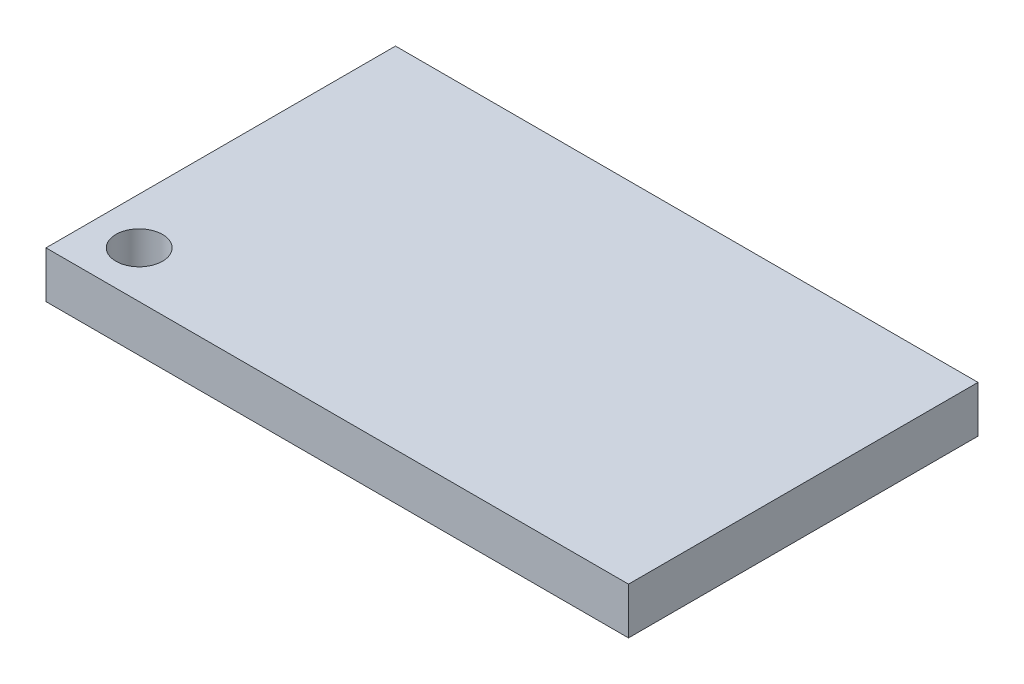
ISO-10303-21;
HEADER;
FILE_DESCRIPTION(('STEP AP214'),'2;1');
FILE_NAME('part.step','',(''),(''),'','','');
FILE_SCHEMA(('AUTOMOTIVE_DESIGN { 1 0 10303 214 1 1 1 1 }'));
ENDSEC;
DATA;
#1=APPLICATION_CONTEXT('core data for automotive mechanical design processes');
#2=APPLICATION_PROTOCOL_DEFINITION('international standard','automotive_design',2000,#1);
#3=PRODUCT_CONTEXT('',#1,'mechanical');
#4=PRODUCT('Part','Part','',(#3));
#5=PRODUCT_RELATED_PRODUCT_CATEGORY('part','',(#4));
#6=PRODUCT_DEFINITION_FORMATION('','',#4);
#7=PRODUCT_DEFINITION_CONTEXT('part definition',#1,'design');
#8=PRODUCT_DEFINITION('design','',#6,#7);
#9=PRODUCT_DEFINITION_SHAPE('','',#8);
#10=(LENGTH_UNIT() NAMED_UNIT(*) SI_UNIT(.MILLI.,.METRE.));
#11=(NAMED_UNIT(*) PLANE_ANGLE_UNIT() SI_UNIT($,.RADIAN.));
#12=(NAMED_UNIT(*) SI_UNIT($,.STERADIAN.) SOLID_ANGLE_UNIT());
#13=UNCERTAINTY_MEASURE_WITH_UNIT(LENGTH_MEASURE(1.E-05),#10,'distance_accuracy_value','');
#14=(GEOMETRIC_REPRESENTATION_CONTEXT(3) GLOBAL_UNCERTAINTY_ASSIGNED_CONTEXT((#13)) GLOBAL_UNIT_ASSIGNED_CONTEXT((#10,
#11,#12)) REPRESENTATION_CONTEXT('',''));
#15=CARTESIAN_POINT('',(0.,0.,0.));
#16=DIRECTION('',(0.,0.,1.));
#17=DIRECTION('',(1.,0.,0.));
#18=AXIS2_PLACEMENT_3D('',#15,#16,#17);
#19=CARTESIAN_POINT('',(0.,10.,0.));
#20=DIRECTION('',(1.,0.,0.));
#21=DIRECTION('',(0.,0.,-1.));
#22=AXIS2_PLACEMENT_3D('',#19,#20,#21);
#23=PLANE('',#22);
#24=DIRECTION('',(0.,0.,1.));
#25=VECTOR('',#24,1.);
#26=CARTESIAN_POINT('',(0.,0.,0.));
#27=LINE('',#26,#25);
#28=CARTESIAN_POINT('',(0.,0.,-75.));
#29=VERTEX_POINT('',#28);
#30=CARTESIAN_POINT('',(0.,0.,0.));
#31=VERTEX_POINT('',#30);
#32=EDGE_CURVE('E77',#29,#31,#27,.T.);
#33=ORIENTED_EDGE('',*,*,#32,.T.);
#34=DIRECTION('',(0.,-1.,0.));
#35=VECTOR('',#34,1.);
#36=CARTESIAN_POINT('',(0.,10.,0.));
#37=LINE('',#36,#35);
#38=CARTESIAN_POINT('',(0.,10.,0.));
#39=VERTEX_POINT('',#38);
#40=EDGE_CURVE('E11',#39,#31,#37,.T.);
#41=ORIENTED_EDGE('',*,*,#40,.F.);
#42=DIRECTION('',(0.,0.,1.));
#43=VECTOR('',#42,1.);
#44=CARTESIAN_POINT('',(0.,10.,0.));
#45=LINE('',#44,#43);
#46=CARTESIAN_POINT('',(0.,10.,-75.));
#47=VERTEX_POINT('',#46);
#48=EDGE_CURVE('E100',#47,#39,#45,.T.);
#49=ORIENTED_EDGE('',*,*,#48,.F.);
#50=DIRECTION('',(0.,-1.,0.));
#51=VECTOR('',#50,1.);
#52=CARTESIAN_POINT('',(0.,10.,-75.));
#53=LINE('',#52,#51);
#54=EDGE_CURVE('E89',#47,#29,#53,.T.);
#55=ORIENTED_EDGE('',*,*,#54,.T.);
#56=EDGE_LOOP('',(#33,#41,#49,#55));
#57=FACE_BOUND('',#56,.T.);
#58=ADVANCED_FACE('F33',(#57),#23,.F.);
#59=CARTESIAN_POINT('',(0.,10.,0.));
#60=DIRECTION('',(0.,0.,-1.));
#61=DIRECTION('',(-1.,0.,0.));
#62=AXIS2_PLACEMENT_3D('',#59,#60,#61);
#63=PLANE('',#62);
#64=DIRECTION('',(1.,0.,0.));
#65=VECTOR('',#64,1.);
#66=CARTESIAN_POINT('',(0.,0.,0.));
#67=LINE('',#66,#65);
#68=CARTESIAN_POINT('',(125.,0.,0.));
#69=VERTEX_POINT('',#68);
#70=EDGE_CURVE('E73',#31,#69,#67,.T.);
#71=ORIENTED_EDGE('',*,*,#70,.T.);
#72=DIRECTION('',(0.,-1.,0.));
#73=VECTOR('',#72,1.);
#74=CARTESIAN_POINT('',(125.,10.,0.));
#75=LINE('',#74,#73);
#76=CARTESIAN_POINT('',(125.,10.,0.));
#77=VERTEX_POINT('',#76);
#78=EDGE_CURVE('E40',#77,#69,#75,.T.);
#79=ORIENTED_EDGE('',*,*,#78,.F.);
#80=DIRECTION('',(1.,0.,0.));
#81=VECTOR('',#80,1.);
#82=CARTESIAN_POINT('',(0.,10.,0.));
#83=LINE('',#82,#81);
#84=EDGE_CURVE('E85',#39,#77,#83,.T.);
#85=ORIENTED_EDGE('',*,*,#84,.F.);
#86=ORIENTED_EDGE('',*,*,#40,.T.);
#87=EDGE_LOOP('',(#71,#79,#85,#86));
#88=FACE_BOUND('',#87,.T.);
#89=ADVANCED_FACE('F84',(#88),#63,.F.);
#90=CARTESIAN_POINT('',(125.,10.,0.));
#91=DIRECTION('',(-1.,0.,0.));
#92=DIRECTION('',(0.,0.,1.));
#93=AXIS2_PLACEMENT_3D('',#90,#91,#92);
#94=PLANE('',#93);
#95=DIRECTION('',(0.,0.,-1.));
#96=VECTOR('',#95,1.);
#97=CARTESIAN_POINT('',(125.,0.,0.));
#98=LINE('',#97,#96);
#99=CARTESIAN_POINT('',(125.,0.,-75.));
#100=VERTEX_POINT('',#99);
#101=EDGE_CURVE('E78',#69,#100,#98,.T.);
#102=ORIENTED_EDGE('',*,*,#101,.T.);
#103=DIRECTION('',(0.,-1.,0.));
#104=VECTOR('',#103,1.);
#105=CARTESIAN_POINT('',(125.,10.,-75.));
#106=LINE('',#105,#104);
#107=CARTESIAN_POINT('',(125.,10.,-75.));
#108=VERTEX_POINT('',#107);
#109=EDGE_CURVE('E106',#108,#100,#106,.T.);
#110=ORIENTED_EDGE('',*,*,#109,.F.);
#111=DIRECTION('',(0.,0.,-1.));
#112=VECTOR('',#111,1.);
#113=CARTESIAN_POINT('',(125.,10.,0.));
#114=LINE('',#113,#112);
#115=EDGE_CURVE('E52',#77,#108,#114,.T.);
#116=ORIENTED_EDGE('',*,*,#115,.F.);
#117=ORIENTED_EDGE('',*,*,#78,.T.);
#118=EDGE_LOOP('',(#102,#110,#116,#117));
#119=FACE_BOUND('',#118,.T.);
#120=ADVANCED_FACE('F109',(#119),#94,.F.);
#121=CARTESIAN_POINT('',(0.,10.,-75.));
#122=DIRECTION('',(0.,0.,1.));
#123=DIRECTION('',(1.,0.,0.));
#124=AXIS2_PLACEMENT_3D('',#121,#122,#123);
#125=PLANE('',#124);
#126=DIRECTION('',(-1.,0.,0.));
#127=VECTOR('',#126,1.);
#128=CARTESIAN_POINT('',(0.,0.,-75.));
#129=LINE('',#128,#127);
#130=EDGE_CURVE('E98',#100,#29,#129,.T.);
#131=ORIENTED_EDGE('',*,*,#130,.T.);
#132=ORIENTED_EDGE('',*,*,#54,.F.);
#133=DIRECTION('',(-1.,0.,0.));
#134=VECTOR('',#133,1.);
#135=CARTESIAN_POINT('',(0.,10.,-75.));
#136=LINE('',#135,#134);
#137=EDGE_CURVE('E47',#108,#47,#136,.T.);
#138=ORIENTED_EDGE('',*,*,#137,.F.);
#139=ORIENTED_EDGE('',*,*,#109,.T.);
#140=EDGE_LOOP('',(#131,#132,#138,#139));
#141=FACE_BOUND('',#140,.T.);
#142=ADVANCED_FACE('F111',(#141),#125,.F.);
#143=CARTESIAN_POINT('',(0.,10.,-75.));
#144=DIRECTION('',(0.,-1.,0.));
#145=DIRECTION('',(0.,0.,-1.));
#146=AXIS2_PLACEMENT_3D('',#143,#144,#145);
#147=PLANE('',#146);
#148=CARTESIAN_POINT('',(10.,10.,-9.99999999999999));
#149=DIRECTION('',(0.,1.,0.));
#150=DIRECTION('',(0.,0.,1.));
#151=AXIS2_PLACEMENT_3D('',#148,#149,#150);
#152=CIRCLE('',#151,5.);
#153=CARTESIAN_POINT('',(10.,10.,-4.99999999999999));
#154=VERTEX_POINT('',#153);
#155=EDGE_CURVE('E93',#154,#154,#152,.T.);
#156=ORIENTED_EDGE('',*,*,#155,.F.);
#157=EDGE_LOOP('',(#156));
#158=FACE_BOUND('',#157,.T.);
#159=ORIENTED_EDGE('',*,*,#48,.T.);
#160=ORIENTED_EDGE('',*,*,#84,.T.);
#161=ORIENTED_EDGE('',*,*,#115,.T.);
#162=ORIENTED_EDGE('',*,*,#137,.T.);
#163=EDGE_LOOP('',(#159,#160,#161,#162));
#164=FACE_BOUND('',#163,.T.);
#165=ADVANCED_FACE('F112',(#158,#164),#147,.F.);
#166=CARTESIAN_POINT('',(0.,0.,-75.));
#167=DIRECTION('',(0.,-1.,0.));
#168=DIRECTION('',(0.,0.,-1.));
#169=AXIS2_PLACEMENT_3D('',#166,#167,#168);
#170=PLANE('',#169);
#171=CARTESIAN_POINT('',(10.,0.,-9.99999999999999));
#172=DIRECTION('',(0.,1.,0.));
#173=DIRECTION('',(0.,0.,1.));
#174=AXIS2_PLACEMENT_3D('',#171,#172,#173);
#175=CIRCLE('',#174,5.);
#176=CARTESIAN_POINT('',(10.,0.,-4.99999999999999));
#177=VERTEX_POINT('',#176);
#178=EDGE_CURVE('E90',#177,#177,#175,.T.);
#179=ORIENTED_EDGE('',*,*,#178,.T.);
#180=EDGE_LOOP('',(#179));
#181=FACE_BOUND('',#180,.T.);
#182=ORIENTED_EDGE('',*,*,#32,.F.);
#183=ORIENTED_EDGE('',*,*,#130,.F.);
#184=ORIENTED_EDGE('',*,*,#101,.F.);
#185=ORIENTED_EDGE('',*,*,#70,.F.);
#186=EDGE_LOOP('',(#182,#183,#184,#185));
#187=FACE_BOUND('',#186,.T.);
#188=ADVANCED_FACE('F74',(#181,#187),#170,.T.);
#189=CARTESIAN_POINT('',(10.,0.,-9.99999999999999));
#190=DIRECTION('',(0.,1.,0.));
#191=DIRECTION('',(0.,0.,1.));
#192=AXIS2_PLACEMENT_3D('',#189,#190,#191);
#193=CYLINDRICAL_SURFACE('',#192,5.);
#194=ORIENTED_EDGE('',*,*,#178,.F.);
#195=EDGE_LOOP('',(#194));
#196=FACE_BOUND('',#195,.T.);
#197=ORIENTED_EDGE('',*,*,#155,.T.);
#198=EDGE_LOOP('',(#197));
#199=FACE_BOUND('',#198,.T.);
#200=ADVANCED_FACE('F120',(#196,#199),#193,.F.);
#201=CLOSED_SHELL('',(#58,#89,#120,#142,#165,#188,#200));
#202=MANIFOLD_SOLID_BREP('B2',#201);
#203=ADVANCED_BREP_SHAPE_REPRESENTATION('',(#18,#202),#14);
#204=SHAPE_DEFINITION_REPRESENTATION(#9,#203);
ENDSEC;
END-ISO-10303-21;
